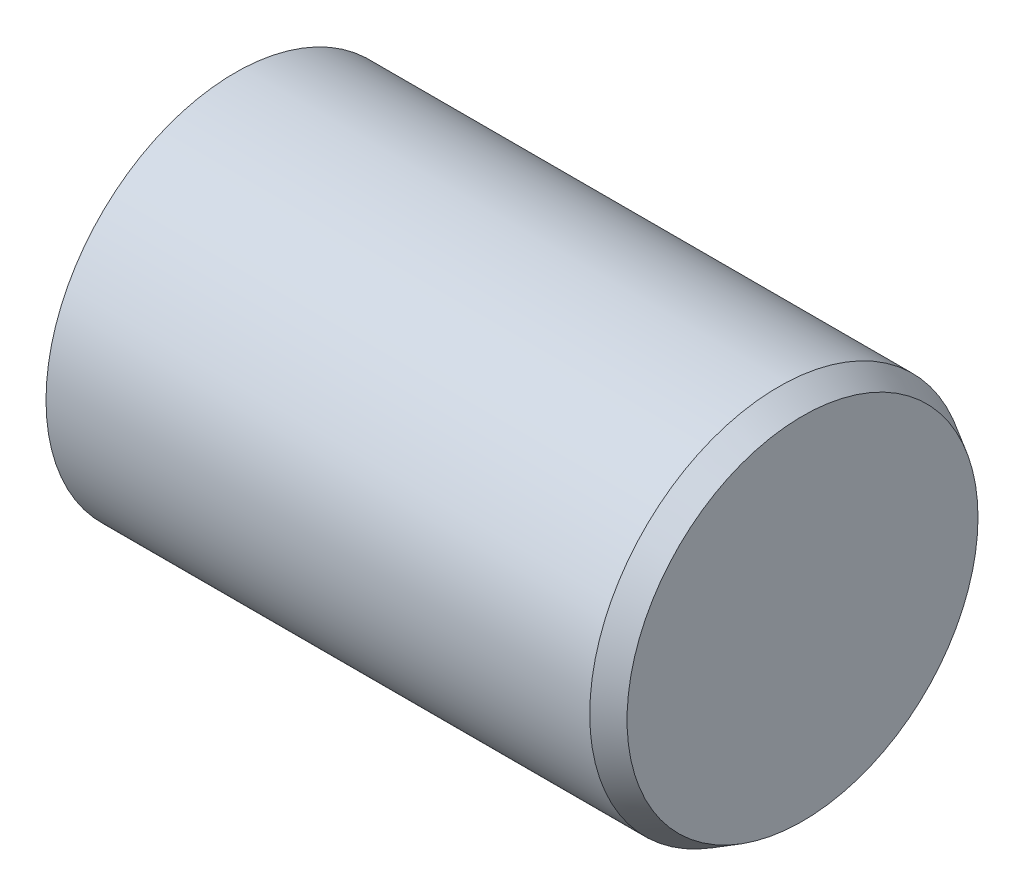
ISO-10303-21;
HEADER;
FILE_DESCRIPTION(('STEP AP214'),'2;1');
FILE_NAME('part.step','',(''),(''),'','','');
FILE_SCHEMA(('AUTOMOTIVE_DESIGN { 1 0 10303 214 1 1 1 1 }'));
ENDSEC;
DATA;
#1=APPLICATION_CONTEXT('core data for automotive mechanical design processes');
#2=APPLICATION_PROTOCOL_DEFINITION('international standard','automotive_design',2000,#1);
#3=PRODUCT_CONTEXT('',#1,'mechanical');
#4=PRODUCT('Part','Part','',(#3));
#5=PRODUCT_RELATED_PRODUCT_CATEGORY('part','',(#4));
#6=PRODUCT_DEFINITION_FORMATION('','',#4);
#7=PRODUCT_DEFINITION_CONTEXT('part definition',#1,'design');
#8=PRODUCT_DEFINITION('design','',#6,#7);
#9=PRODUCT_DEFINITION_SHAPE('','',#8);
#10=(LENGTH_UNIT() NAMED_UNIT(*) SI_UNIT(.MILLI.,.METRE.));
#11=(NAMED_UNIT(*) PLANE_ANGLE_UNIT() SI_UNIT($,.RADIAN.));
#12=(NAMED_UNIT(*) SI_UNIT($,.STERADIAN.) SOLID_ANGLE_UNIT());
#13=UNCERTAINTY_MEASURE_WITH_UNIT(LENGTH_MEASURE(1.E-05),#10,'distance_accuracy_value','');
#14=(GEOMETRIC_REPRESENTATION_CONTEXT(3) GLOBAL_UNCERTAINTY_ASSIGNED_CONTEXT((#13)) GLOBAL_UNIT_ASSIGNED_CONTEXT((#10,
#11,#12)) REPRESENTATION_CONTEXT('',''));
#15=CARTESIAN_POINT('',(0.,0.,0.));
#16=DIRECTION('',(0.,0.,1.));
#17=DIRECTION('',(1.,0.,0.));
#18=AXIS2_PLACEMENT_3D('',#15,#16,#17);
#19=CARTESIAN_POINT('',(12.,0.,0.));
#20=DIRECTION('',(-1.,0.,0.));
#21=DIRECTION('',(0.,0.,1.));
#22=AXIS2_PLACEMENT_3D('',#19,#20,#21);
#23=CYLINDRICAL_SURFACE('',#22,4.);
#24=CARTESIAN_POINT('',(11.5,0.,0.));
#25=DIRECTION('',(1.,0.,0.));
#26=DIRECTION('',(0.,0.,-1.));
#27=AXIS2_PLACEMENT_3D('',#24,#25,#26);
#28=CIRCLE('',#27,4.);
#29=CARTESIAN_POINT('',(11.5,0.,-4.));
#30=VERTEX_POINT('',#29);
#31=EDGE_CURVE('E11',#30,#30,#28,.F.);
#32=ORIENTED_EDGE('',*,*,#31,.T.);
#33=EDGE_LOOP('',(#32));
#34=FACE_BOUND('',#33,.T.);
#35=CARTESIAN_POINT('',(0.,0.,0.));
#36=DIRECTION('',(1.,0.,0.));
#37=DIRECTION('',(0.,0.,-1.));
#38=AXIS2_PLACEMENT_3D('',#35,#36,#37);
#39=CIRCLE('',#38,4.);
#40=CARTESIAN_POINT('',(0.,0.,-4.));
#41=VERTEX_POINT('',#40);
#42=EDGE_CURVE('E51',#41,#41,#39,.T.);
#43=ORIENTED_EDGE('',*,*,#42,.T.);
#44=EDGE_LOOP('',(#43));
#45=FACE_BOUND('',#44,.T.);
#46=ADVANCED_FACE('F30',(#34,#45),#23,.T.);
#47=CARTESIAN_POINT('',(12.,0.,0.));
#48=DIRECTION('',(1.,0.,0.));
#49=DIRECTION('',(0.,0.,-1.));
#50=AXIS2_PLACEMENT_3D('',#47,#48,#49);
#51=PLANE('',#50);
#52=CARTESIAN_POINT('',(12.,0.,0.));
#53=DIRECTION('',(1.,0.,0.));
#54=DIRECTION('',(0.,0.,-1.));
#55=AXIS2_PLACEMENT_3D('',#52,#53,#54);
#56=CIRCLE('',#55,3.71132486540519);
#57=CARTESIAN_POINT('',(12.,0.,-3.71132486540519));
#58=VERTEX_POINT('',#57);
#59=EDGE_CURVE('E36',#58,#58,#56,.T.);
#60=ORIENTED_EDGE('',*,*,#59,.T.);
#61=EDGE_LOOP('',(#60));
#62=FACE_BOUND('',#61,.T.);
#63=ADVANCED_FACE('F58',(#62),#51,.T.);
#64=CARTESIAN_POINT('',(0.,0.,0.));
#65=DIRECTION('',(1.,0.,0.));
#66=DIRECTION('',(0.,0.,-1.));
#67=AXIS2_PLACEMENT_3D('',#64,#65,#66);
#68=PLANE('',#67);
#69=CARTESIAN_POINT('',(0.,0.,0.));
#70=DIRECTION('',(-1.,0.,0.));
#71=DIRECTION('',(0.,0.,1.));
#72=AXIS2_PLACEMENT_3D('',#69,#70,#71);
#73=CIRCLE('',#72,1.65);
#74=CARTESIAN_POINT('',(0.,0.,1.65));
#75=VERTEX_POINT('',#74);
#76=EDGE_CURVE('E48',#75,#75,#73,.T.);
#77=ORIENTED_EDGE('',*,*,#76,.F.);
#78=EDGE_LOOP('',(#77));
#79=FACE_BOUND('',#78,.T.);
#80=ORIENTED_EDGE('',*,*,#42,.F.);
#81=EDGE_LOOP('',(#80));
#82=FACE_BOUND('',#81,.T.);
#83=ADVANCED_FACE('F62',(#79,#82),#68,.F.);
#84=CARTESIAN_POINT('',(12.,0.,0.));
#85=DIRECTION('',(-1.,0.,0.));
#86=DIRECTION('',(0.,0.,1.));
#87=AXIS2_PLACEMENT_3D('',#84,#85,#86);
#88=CONICAL_SURFACE('',#87,3.71132486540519,0.523598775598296);
#89=ORIENTED_EDGE('',*,*,#31,.F.);
#90=EDGE_LOOP('',(#89));
#91=FACE_BOUND('',#90,.T.);
#92=ORIENTED_EDGE('',*,*,#59,.F.);
#93=EDGE_LOOP('',(#92));
#94=FACE_BOUND('',#93,.T.);
#95=ADVANCED_FACE('F60',(#91,#94),#88,.T.);
#96=CARTESIAN_POINT('',(0.,0.,0.));
#97=DIRECTION('',(-1.,0.,0.));
#98=DIRECTION('',(0.,0.,1.));
#99=AXIS2_PLACEMENT_3D('',#96,#97,#98);
#100=CYLINDRICAL_SURFACE('',#99,1.65);
#101=CARTESIAN_POINT('',(8.,0.,0.));
#102=DIRECTION('',(-1.,0.,0.));
#103=DIRECTION('',(0.,0.,1.));
#104=AXIS2_PLACEMENT_3D('',#101,#102,#103);
#105=CIRCLE('',#104,1.65);
#106=CARTESIAN_POINT('',(8.,0.,1.65));
#107=VERTEX_POINT('',#106);
#108=EDGE_CURVE('E46',#107,#107,#105,.T.);
#109=ORIENTED_EDGE('',*,*,#108,.F.);
#110=EDGE_LOOP('',(#109));
#111=FACE_BOUND('',#110,.T.);
#112=ORIENTED_EDGE('',*,*,#76,.T.);
#113=EDGE_LOOP('',(#112));
#114=FACE_BOUND('',#113,.T.);
#115=ADVANCED_FACE('F42',(#111,#114),#100,.F.);
#116=CARTESIAN_POINT('',(8.,0.,0.));
#117=DIRECTION('',(-1.,0.,0.));
#118=DIRECTION('',(0.,0.,1.));
#119=AXIS2_PLACEMENT_3D('',#116,#117,#118);
#120=CONICAL_SURFACE('',#119,1.65,1.0471975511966);
#121=CARTESIAN_POINT('',(8.95262794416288,0.,0.));
#122=VERTEX_POINT('',#121);
#123=VERTEX_LOOP('',#122);
#124=FACE_BOUND('',#123,.T.);
#125=ORIENTED_EDGE('',*,*,#108,.T.);
#126=EDGE_LOOP('',(#125));
#127=FACE_BOUND('',#126,.T.);
#128=ADVANCED_FACE('F39',(#124,#127),#120,.F.);
#129=CLOSED_SHELL('',(#46,#63,#83,#95,#115,#128));
#130=MANIFOLD_SOLID_BREP('B2',#129);
#131=ADVANCED_BREP_SHAPE_REPRESENTATION('',(#18,#130),#14);
#132=SHAPE_DEFINITION_REPRESENTATION(#9,#131);
ENDSEC;
END-ISO-10303-21;
